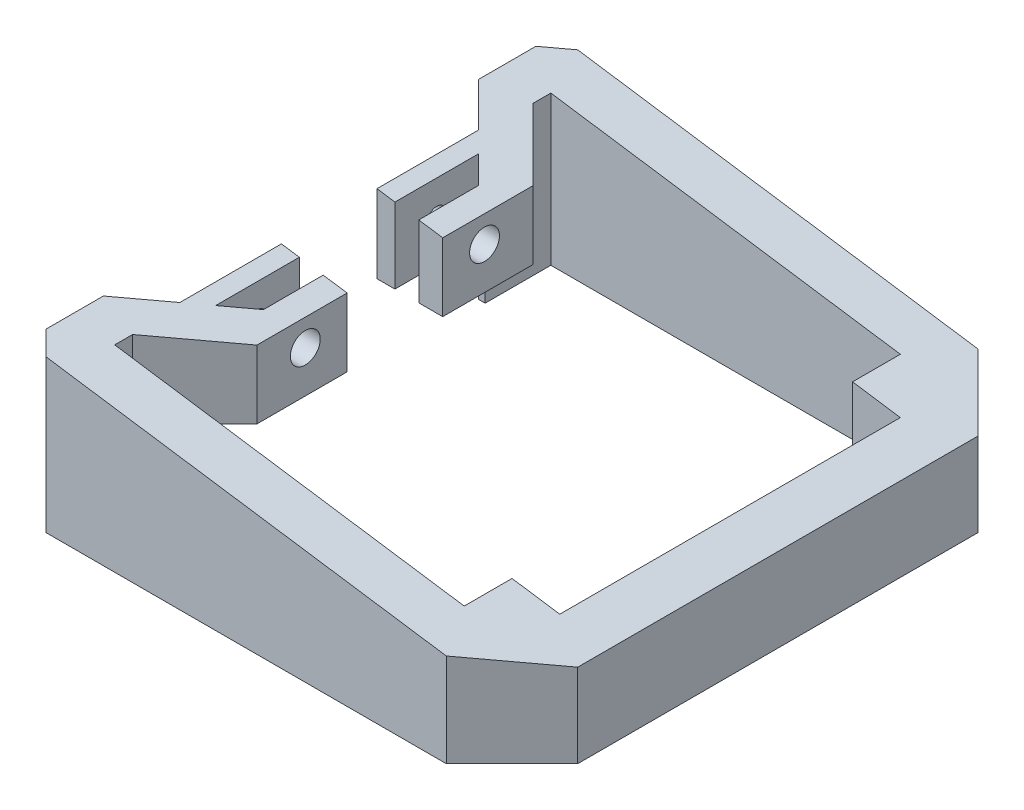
from build123d import *

# Parameters (mm, degrees)
SKETCH1_R                      = 1.1
BOSS_EXTRUDE1_DEPTH            = 6
BOSS_EXTRUDE2_DEPTH            = 7
SKETCH4_R                      = 1.25
CUT_EXTRUDE1_DEPTH             = 2
CUT_EXTRUDE3_REACH             = 55.38
SKETCH7_W                      = 8
SKETCH7_H                      = 13
CUT_EXTRUDE3_DIRECTION_2_DEPTH = 6
SKETCH8_R                      = 0.75
CUT_EXTRUDE4_DEPTH             = 2
CUT_EXTRUDE5_DEPTH             = 61.582588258
CUT_EXTRUDE6_DEPTH             = 6


with BuildPart() as part:
    # Sketch1 → Boss-Extrude1 (new body)
    with BuildSketch(Plane(origin=(0, 0, 0), x_dir=(1, 0, 0), z_dir=(0, 1, 0))):
        Polygon((39, 0), (39, -33.5), (33.5, -39), (0, -39), (-1.75, -37.25), (-1.75, -29.5), (1.45, -26.3), (1.45, -7.2), (-1.75, -4), (-1.75, 3.75), (0, 5.5), (33.5, 5.5), align=None)
        with Locations(Location((0, 0, 0), (0, 0, 270))):
            Circle(SKETCH1_R, mode=Mode.SUBTRACT)
        with Locations(Location((33.5, 0, 0), (0, 0, 270))):
            Circle(SKETCH1_R, mode=Mode.SUBTRACT)
        with Locations(Location((0, -33.5, 0), (0, 0, 270))):
            Circle(SKETCH1_R, mode=Mode.SUBTRACT)
        with Locations(Location((33.5, -33.5, 0), (0, 0, 270))):
            Circle(SKETCH1_R, mode=Mode.SUBTRACT)
        Polygon((31, 1.5), (31, -2.5), (35, -2.5), (35, -31), (31, -31), (31, -35), (1.75, -35), (1.75, -33.5), (6.95, -28.3), (6.95, -5.2), (1.75, 0), (1.75, 1.5), align=None, mode=Mode.SUBTRACT)
        Polygon((4.95, -22.8), (4.95, -10.7), (2.95, -8.7), (2.95, -24.8), align=None, mode=Mode.SUBTRACT)
    extrude(amount=BOSS_EXTRUDE1_DEPTH)

    # Sketch2 → Boss-Extrude2 (add)
    with BuildSketch(Plane(origin=(0, 6, 0), x_dir=(1, 0, 0), z_dir=(0, 1, 0))):
        Polygon((0, 5.5), (-1.75, 3.75), (-1.75, -1.05), (1.45, -4.25), (1.45, -29.25), (-1.75, -32.45), (-1.75, -37.25), (0, -39), (33.5, -39), (39, -33.5), (39, 0), (33.5, 5.5), align=None)
        Polygon((4.95, -7.75), (4.95, -25.75), (2.95, -27.75), (2.95, -5.75), align=None, mode=Mode.SUBTRACT)
        Polygon((1.75, -33.5), (1.75, -35), (31, -35), (31, -31), (35, -31), (35, -2.5), (31, -2.5), (31, 1.5), (1.75, 1.5), (1.75, 0), (6.95, -5.2), (6.95, -28.3), align=None, mode=Mode.SUBTRACT)
    extrude(amount=BOSS_EXTRUDE2_DEPTH)

    # Sketch4 → Cut-Extrude1 (cut)
    with BuildSketch(Plane(origin=(6.95, 0, 0), x_dir=(0, 0, -1), z_dir=(1, 0, 0))):
        with Locations((-24.25, 9.5)):
            Circle(SKETCH4_R)
        with Locations((-9.25, 9.5)):
            Circle(SKETCH4_R)
    extrude(amount=-CUT_EXTRUDE1_DEPTH, mode=Mode.SUBTRACT)

    # Sketch7 → Cut-Extrude3 (cut, up to next)
    with BuildSketch(Plane.ZY.offset(-4.95), mode=Mode.PRIVATE) as cut_extrude3_sk1:
        with Locations((16.75, 6.5)):
            Rectangle(SKETCH7_W, SKETCH7_H)
    cut_extrude3_tool1 = extrude(cut_extrude3_sk1.sketch, amount=-CUT_EXTRUDE3_REACH, mode=Mode.PRIVATE) & part.part
    add(cut_extrude3_tool1.solids().sort_by_distance((4.95, 6.5, 16.75))[0], mode=Mode.SUBTRACT)

    # Sketch7 → Cut-Extrude3 direction 2 (cut)
    with BuildSketch(Plane.ZY.offset(-4.95)):
        with Locations((16.75, 6.5)):
            Rectangle(SKETCH7_W, SKETCH7_H)
    extrude(amount=CUT_EXTRUDE3_DIRECTION_2_DEPTH, mode=Mode.SUBTRACT)

    # Sketch8 → Cut-Extrude4 (cut)
    with BuildSketch(Plane(origin=(2.95, 0, 0), x_dir=(0, 0, -1), z_dir=(1, 0, 0))):
        with Locations((-24.25, 9.5)):
            Circle(SKETCH8_R)
        with Locations((-9.25, 9.5)):
            Circle(SKETCH8_R)
    extrude(amount=-CUT_EXTRUDE4_DEPTH, mode=Mode.SUBTRACT)

    # Sketch9 → Cut-Extrude5 (cut, through all)
    with BuildSketch(Plane.XY.offset(39)):
        Polygon((-1.75, 13), (39, 7), (39, 13), align=None)
    extrude(amount=-CUT_EXTRUDE5_DEPTH, mode=Mode.SUBTRACT)

    # Sketch10 → Cut-Extrude6 (cut)
    with BuildSketch(Plane.XZ):
        Polygon((-1.75, 32.45), (-1.75, 29.5), (1.45, 26.3), (1.45, 7.2), (-1.75, 4), (-1.75, 1.05), (1.2, 4), (1.75, 4), (1.75, 0), (6.95, 5.2), (6.95, 28.3), (1.75, 33.5), (1.75, 29.5), (1.2, 29.5), align=None)
    extrude(amount=-CUT_EXTRUDE6_DEPTH, mode=Mode.SUBTRACT)


solid = part.part
